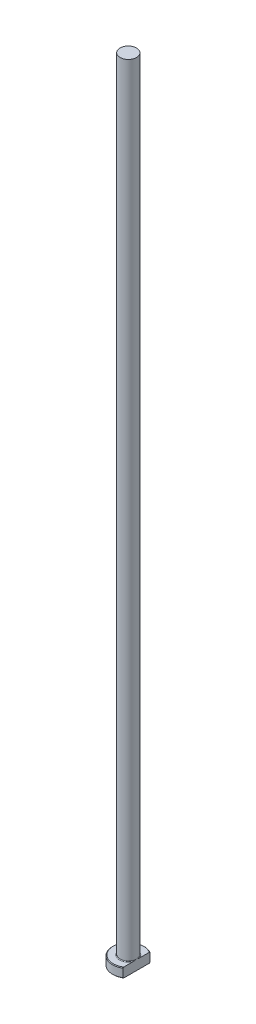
from build123d import *
from build123d.topology import SkipClean

# Parameters (mm, degrees)
CHAMFER1_SIZE = 0.2
FILLET1_R     = 0.2
KEY_DEPTH     = 251.099980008


with BuildPart() as part:
    # Sketch1 → Revolve1 (revolve)
    with BuildSketch(Plane.XY, mode=Mode.PRIVATE) as revolve1_sk:
        Polygon((0, 0), (-5, 0), (-5, 3), (-2.6, 3), (-2.6, 250), (0, 250), align=None)
    revolve(revolve1_sk.sketch.rotate(Axis((0, 259.958771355, 0), (0, -1, 0)), 270), axis=Axis((0, 259.958771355, 0), (0, -1, 0)))

    # Chamfer1
    chamfer1_edges = [part.edges().sort_by_distance(p)[0] for p in [
        (0, 3, -5),
        (0, 0, -5),
    ]]
    chamfer(chamfer1_edges, length=CHAMFER1_SIZE)

    # Fillet1
    fillet1_edges = [part.edges().sort_by_distance(p)[0] for p in [
        (0, 3, -2.6),
    ]]
    fillet(fillet1_edges, radius=FILLET1_R)

    # Sketch2 → KEY (cut, through all)
    with SkipClean():  # the faces are left unmerged after this step: merging them gives an invalid solid
        with BuildSketch(Plane(origin=(0, 0, 0), x_dir=(1, 0, 0), z_dir=(0, 1, 0))):
            with BuildLine():
                Line((2.6, 4.270831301), (2.6, -4.270831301))
                ThreePointArc((2.6, -4.270831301), (5, 0), (2.6, 4.270831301))
            make_face()
        extrude(amount=KEY_DEPTH, mode=Mode.SUBTRACT)


solid = part.part
